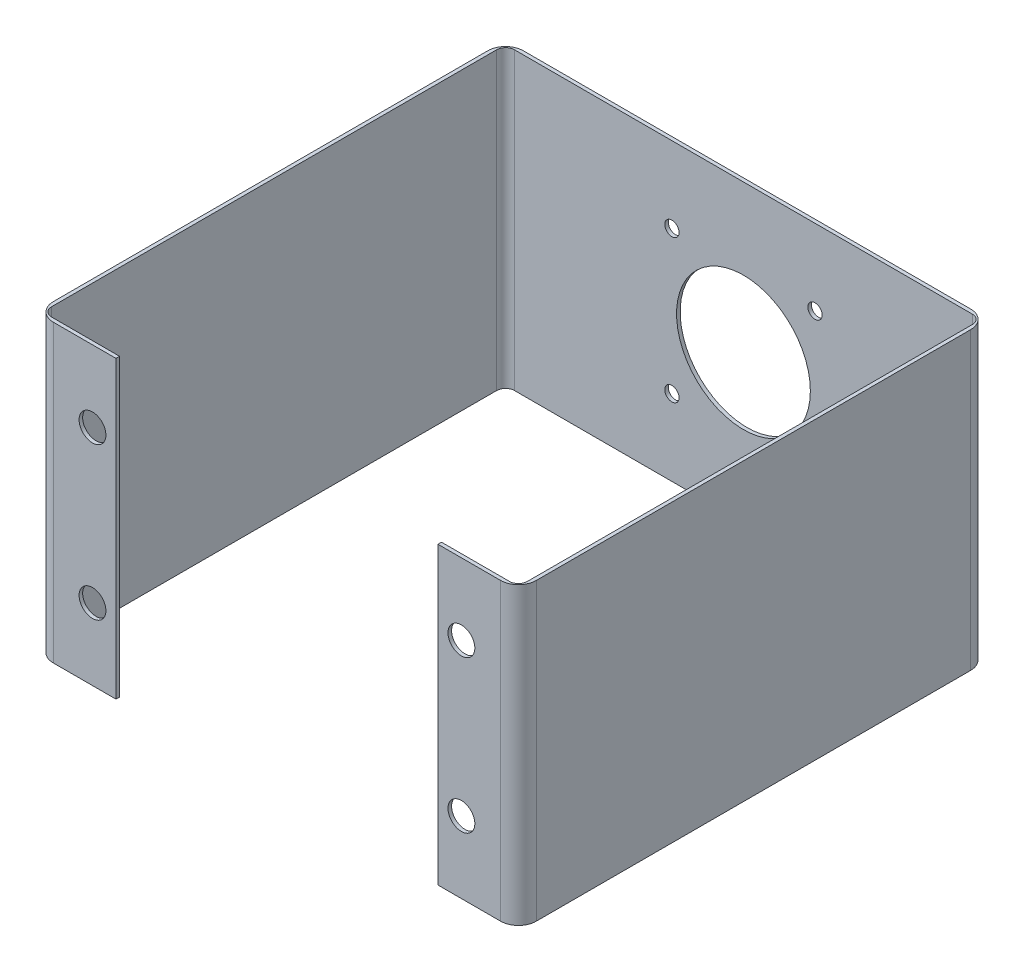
from build123d import *

# Parameters (mm, degrees)
BODY_DEPTH      = 52.3875
BODY_DEPTH_BACK = 52.3875
SKETCH1_W       = 171.45
SKETCH1_H       = 166.878
SKETCH1_W_2     = 168.91
SKETCH1_H_2     = 164.338
SKETCH2_W       = 114.3
SKETCH2_H       = 36.504268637
ENDS_DEPTH      = 160.024032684
FILLET_R1_R     = 3.175
FILLET_R2_R     = 6.35
HOLES_REACH     = 196.786
SKETCH3_R       = 4.7625
DIA_REACH       = 195.699
SKETCH4_R       = 23.749
HOLES2_REACH    = 195.699
SKETCH5_R       = 2.54


with BuildPart() as part:
    # Sketch1 → BODY (new, two sides: drawn at the far end of the back side and taken through both)
    with BuildSketch(Plane(origin=(0, 0, 0), x_dir=(1, 0, 0), z_dir=(0, 1, 0)).offset(-BODY_DEPTH_BACK)):
        Rectangle(SKETCH1_W, SKETCH1_H)
        Rectangle(SKETCH1_W_2, SKETCH1_H_2, mode=Mode.SUBTRACT)
    extrude(amount=BODY_DEPTH + BODY_DEPTH_BACK)

    # Sketch2 → ENDS (cut, through all)
    with BuildSketch(Plane(origin=(0, 52.3875, 0), x_dir=(-1, 0, 0), z_dir=(0, 1, 0))):
        with Locations((0, 74.397286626)):
            Rectangle(SKETCH2_W, SKETCH2_H)
    extrude(amount=-ENDS_DEPTH, mode=Mode.SUBTRACT)

    # Fillet R1
    fillet_r1_edges = [part.edges().sort_by_distance(p)[0] for p in [
        (-84.455, 0, -82.169),
        (-84.455, 0, 82.169),
        (84.455, 0, 82.169),
        (84.455, 0, -82.169),
    ]]
    fillet(fillet_r1_edges, radius=FILLET_R1_R)

    # Fillet R2
    fillet_r2_edges = [part.edges().sort_by_distance(p)[0] for p in [
        (-85.725, 0, -83.439),
        (85.725, 0, -83.439),
        (85.725, 0, 83.439),
        (-85.725, 0, 83.439),
    ]]
    fillet(fillet_r2_edges, radius=FILLET_R2_R)

    # Sketch3 → HOLES (cut, up to next)
    with BuildSketch(Plane.XY.offset(83.439), mode=Mode.PRIVATE) as holes_sk1:
        with Locations((-65.4812, 26.9875)):
            Circle(SKETCH3_R)
    holes_tool1 = extrude(holes_sk1.sketch, amount=-HOLES_REACH, mode=Mode.PRIVATE) & part.part
    # Sketch3 → HOLES (cut, up to next)
    with BuildSketch(Plane.XY.offset(83.439), mode=Mode.PRIVATE) as holes_sk2:
        with Locations((65.4812, 26.9875)):
            Circle(SKETCH3_R)
    holes_tool2 = extrude(holes_sk2.sketch, amount=-HOLES_REACH, mode=Mode.PRIVATE) & part.part
    # Sketch3 → HOLES (cut, up to next)
    with BuildSketch(Plane.XY.offset(83.439), mode=Mode.PRIVATE) as holes_sk3:
        with Locations((-65.4812, -26.9875)):
            Circle(SKETCH3_R)
    holes_tool3 = extrude(holes_sk3.sketch, amount=-HOLES_REACH, mode=Mode.PRIVATE) & part.part
    # Sketch3 → HOLES (cut, up to next)
    with BuildSketch(Plane.XY.offset(83.439), mode=Mode.PRIVATE) as holes_sk4:
        with Locations((65.4812, -26.9875)):
            Circle(SKETCH3_R)
    holes_tool4 = extrude(holes_sk4.sketch, amount=-HOLES_REACH, mode=Mode.PRIVATE) & part.part
    add(holes_tool1.solids().sort_by_distance((-65.4812, 26.9875, 83.439))[0], mode=Mode.SUBTRACT)
    add(holes_tool2.solids().sort_by_distance((65.4812, 26.9875, 83.439))[0], mode=Mode.SUBTRACT)
    add(holes_tool3.solids().sort_by_distance((-65.4812, -26.9875, 83.439))[0], mode=Mode.SUBTRACT)
    add(holes_tool4.solids().sort_by_distance((65.4812, -26.9875, 83.439))[0], mode=Mode.SUBTRACT)

    # Sketch4 → DIA (cut, up to next)
    with BuildSketch(Plane.XY.offset(-82.169), mode=Mode.PRIVATE) as dia_sk1:
        Circle(SKETCH4_R)
    dia_tool1 = extrude(dia_sk1.sketch, amount=-DIA_REACH, mode=Mode.PRIVATE) & part.part
    add(dia_tool1.solids().sort_by_distance((0, 0, -82.169))[0], mode=Mode.SUBTRACT)

    # Sketch5 → HOLES2 (cut, up to next)
    with BuildSketch(Plane.XY.offset(-82.169), mode=Mode.PRIVATE) as holes2_sk1:
        with Locations((-25.4, 25.4)):
            Circle(SKETCH5_R)
    holes2_tool1 = extrude(holes2_sk1.sketch, amount=-HOLES2_REACH, mode=Mode.PRIVATE) & part.part
    # Sketch5 → HOLES2 (cut, up to next)
    with BuildSketch(Plane.XY.offset(-82.169), mode=Mode.PRIVATE) as holes2_sk2:
        with Locations((25.4, 25.4)):
            Circle(SKETCH5_R)
    holes2_tool2 = extrude(holes2_sk2.sketch, amount=-HOLES2_REACH, mode=Mode.PRIVATE) & part.part
    # Sketch5 → HOLES2 (cut, up to next)
    with BuildSketch(Plane.XY.offset(-82.169), mode=Mode.PRIVATE) as holes2_sk3:
        with Locations((25.4, -25.4)):
            Circle(SKETCH5_R)
    holes2_tool3 = extrude(holes2_sk3.sketch, amount=-HOLES2_REACH, mode=Mode.PRIVATE) & part.part
    # Sketch5 → HOLES2 (cut, up to next)
    with BuildSketch(Plane.XY.offset(-82.169), mode=Mode.PRIVATE) as holes2_sk4:
        with Locations((-25.4, -25.4)):
            Circle(SKETCH5_R)
    holes2_tool4 = extrude(holes2_sk4.sketch, amount=-HOLES2_REACH, mode=Mode.PRIVATE) & part.part
    add(holes2_tool1.solids().sort_by_distance((-25.4, 25.4, -82.169))[0], mode=Mode.SUBTRACT)
    add(holes2_tool2.solids().sort_by_distance((25.4, 25.4, -82.169))[0], mode=Mode.SUBTRACT)
    add(holes2_tool3.solids().sort_by_distance((25.4, -25.4, -82.169))[0], mode=Mode.SUBTRACT)
    add(holes2_tool4.solids().sort_by_distance((-25.4, -25.4, -82.169))[0], mode=Mode.SUBTRACT)


solid = part.part
